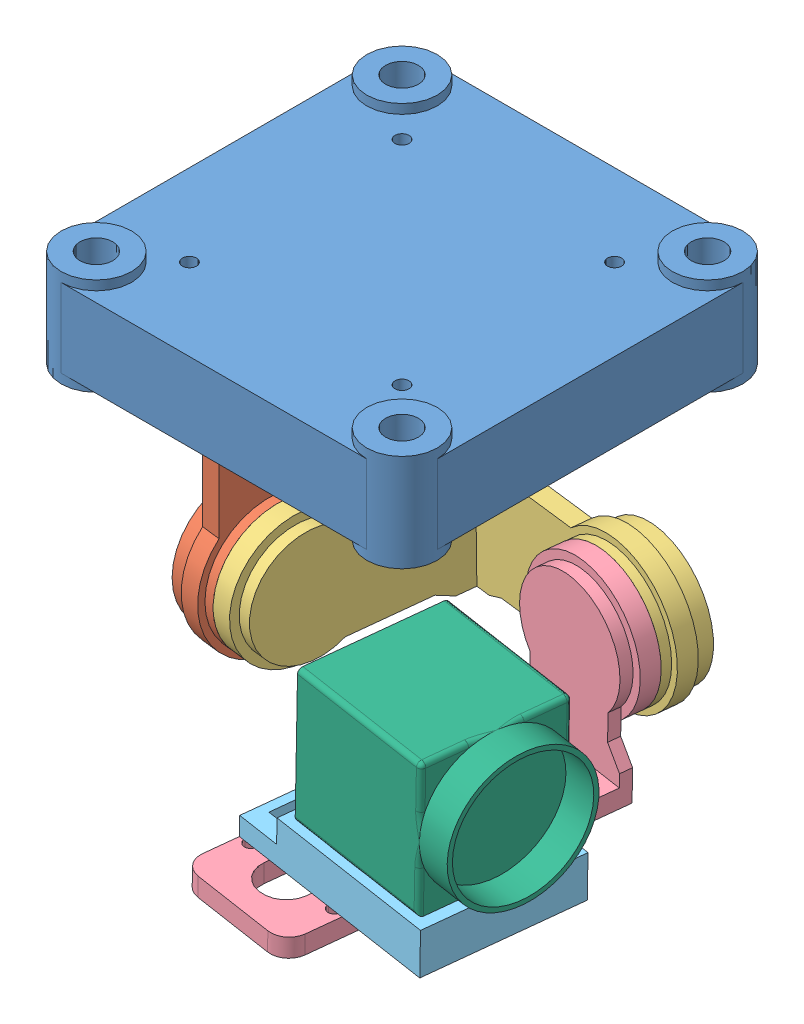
SolidWorks assembly RedesignedGimbalAssembly(detailed).SLDASM, configuration Default (file format 15000). Lengths in mm.
Overall size (88.07 100.43 86.85).
6 component instances, 6 part files, 13 mates.
Components (placement in the parent):
- 1stPartofGimbalModel-1: 1stPartofGimbalModel.SLDPRT [Default] at (25.3287 56.1688 50.3672) size (80 26.7 80)
- 2ndPartofGimbalModel-1: 2ndPartofGimbalModel.SLDPRT [Default] at (25.3287 48.1688 50.3672) x (0.992688 0 0.120709) z (0.120709 0 -0.992688) size (55.6 64 34.8)
- 3rdPartofGimbalModel-1: 3rdPartofGimbalModel.SLDPRT [Default] at (-2.6651 -0.4312 46.9632) x (0.992688 0 0.120709) z (0.1207 0.011933 -0.992617) size (55.6 30.8 53.15)
- 4thPartofGimbalModel-1: 4thPartofGimbalModel.SLDPRT [Default] at (27.1845 -19.8168 25.0227) x (-0.1207 -0.011933 0.992617) z (0.992097 -0.035987 0.120204) size (70.5 38.15 28)
- Camera_MountPAU2-1: Camera_MountPAU2.SLDPRT [Default] at (49.016 -12.2482 67.5622) x (0.1207 0.011933 -0.992617) z (-0.034287 -0.999281 -0.016182) size (32 44 9)
- FLIR-BlackFly-1: FLIR-BlackFly.SLDPRT [Default] at (64.3946 1.7015 69.5999) x (0.1207 0.011933 -0.992617) z (0.992097 -0.035987 0.120204) size (29 29 36.79)
Mates (geometry in assembly coordinates):
- Concentric1: concentric aligned: circle of 1stPartofGimbalModel-1; circle of 2ndPartofGimbalModel-1
- Coincident3: coincident anti-aligned: plane of 1stPartofGimbalModel-1 through (25.3287 48.1688 50.3672) normal (0 -1 0); plane of 2ndPartofGimbalModel-1 through (25.3287 48.1688 50.3672) normal (0 1 0)
- Coincident4: coincident anti-aligned: plane of 2ndPartofGimbalModel-1; plane of 3rdPartofGimbalModel-1
- Concentric2: concentric aligned: circle of 2ndPartofGimbalModel-1; circle of 3rdPartofGimbalModel-1
- Concentric3: concentric anti-aligned: circle of 3rdPartofGimbalModel-1; circle of 4thPartofGimbalModel-1
- Coincident7: coincident anti-aligned: plane of 3rdPartofGimbalModel-1; plane of 4thPartofGimbalModel-1
- Coincident8: coincident anti-aligned: plane of Camera_MountPAU2-1; plane of FLIR-BlackFly-1
- Coincident9: coincident anti-aligned: plane of 4thPartofGimbalModel-1; plane of Camera_MountPAU2-1
- Parallel1: parallel anti-aligned: line of 4thPartofGimbalModel-1 through (40.0996 18.6387 15.4479) axis (-0.377146 0.028629 0.925711); line of Camera_MountPAU2-1 through (25.3909 19.7553 51.5506) axis (0.377146 -0.028629 -0.925711)
- Concentric6: concentric aligned: cylinder of Camera_MountPAU2-1 through (26.435 0.2272 35.2959) axis (0.834581 0.443857 0.326291) radius 1.5; cylinder of FLIR-BlackFly-1 through (29.8568 2.047 36.6337) axis (0.834581 0.443857 0.326291) radius 1.6
- Concentric7: concentric aligned: cylinder of Camera_MountPAU2-1 through (32.1801 -20.7132 49.0867) axis (0.834581 0.443857 0.326291) radius 1.5; cylinder of FLIR-BlackFly-1 through (35.6019 -18.8934 50.4245) axis (0.834581 0.443857 0.326291) radius 1.6
- Coincident11: coincident aligned: line of 4thPartofGimbalModel-1 through (28.3422 13.1723 52.9566) axis (0.401542 -0.89564 0.191292); line of Camera_MountPAU2-1 through (25.3909 19.7553 51.5506) axis (0.401542 -0.89564 0.191292)
- Coincident12: coincident anti-aligned: line of 4thPartofGimbalModel-1 through (40.0996 18.6387 15.4479) axis (-0.377146 0.028629 0.925711); line of Camera_MountPAU2-1 through (25.3909 19.7553 51.5506) axis (0.377146 -0.028629 -0.925711)
